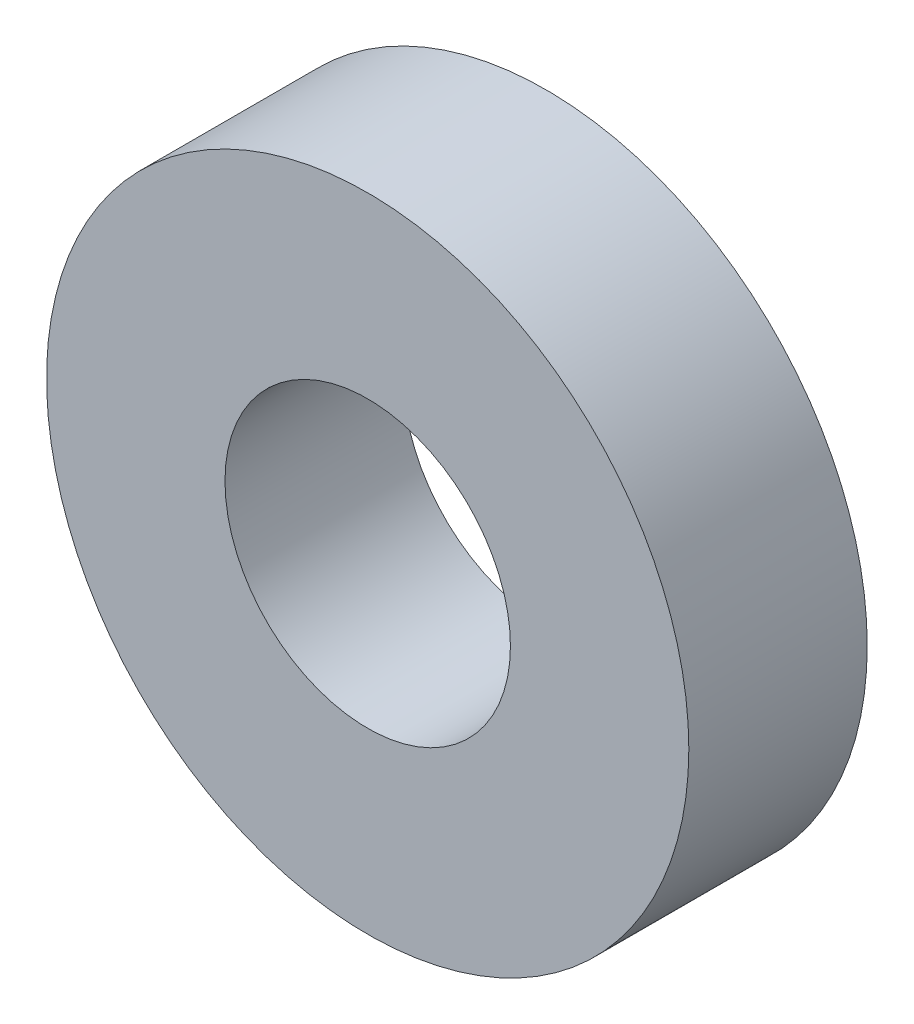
from build123d import *

# Parameters (mm, degrees)
SKETCH1_R      = 14.2875
SKETCH1_R_2    = 6.35
EXTRUDE1_DEPTH = 7.9375


with BuildPart() as part:
    # Sketch1 → Extrude1 (new body)
    with BuildSketch(Plane.XY):
        Circle(SKETCH1_R)
        Circle(SKETCH1_R_2, mode=Mode.SUBTRACT)
    extrude(amount=EXTRUDE1_DEPTH)


solid = part.part
